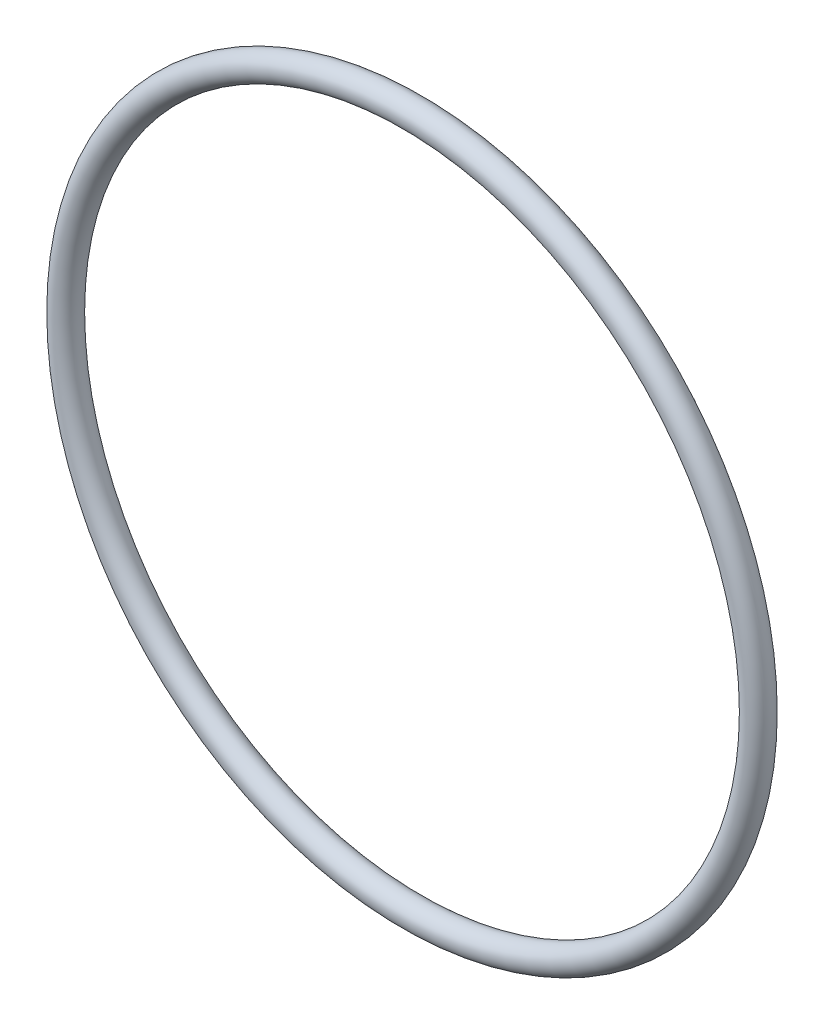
from build123d import *

# Parameters (mm, degrees)
SKETCH1_R = 0.889


with BuildPart() as part:
    # Sketch1 → Revolve1 (revolve)
    with BuildSketch(Plane(origin=(0, 0, 0), x_dir=(0, -1, 0), z_dir=(1, 0, 0)), mode=Mode.PRIVATE) as revolve1_sk:
        with Locations((22.9743, 0)):
            Circle(SKETCH1_R)
    revolve(revolve1_sk.sketch.rotate(Axis((0, 0, 0.889), (0, 0, -1)), 270), axis=Axis((0, 0, 0.889), (0, 0, -1)))


solid = part.part
